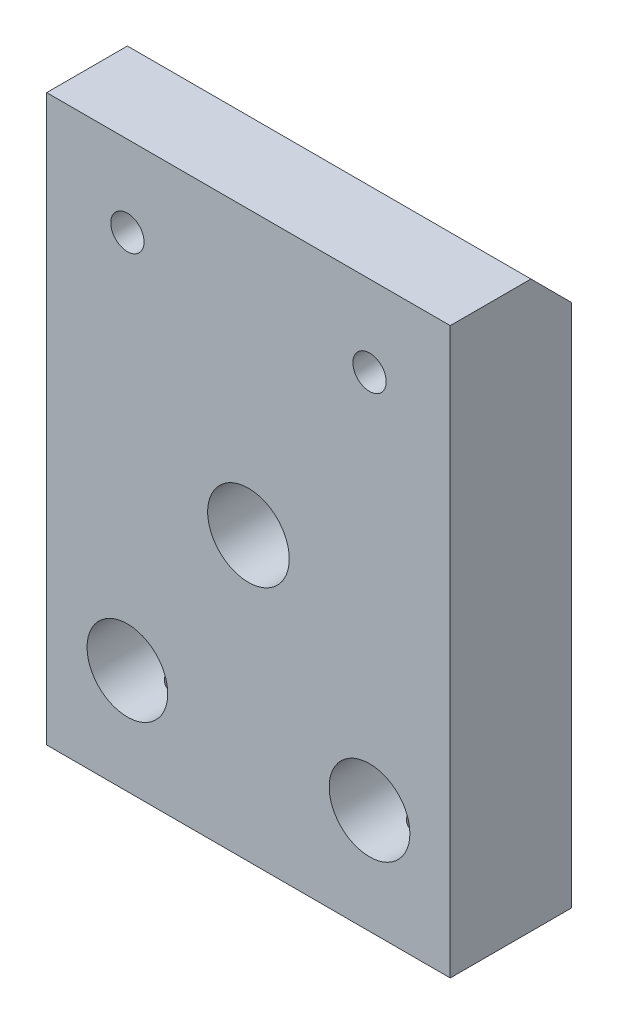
ISO-10303-21;
HEADER;
FILE_DESCRIPTION(('STEP AP214'),'2;1');
FILE_NAME('part.step','',(''),(''),'','','');
FILE_SCHEMA(('AUTOMOTIVE_DESIGN { 1 0 10303 214 1 1 1 1 }'));
ENDSEC;
DATA;
#1=APPLICATION_CONTEXT('core data for automotive mechanical design processes');
#2=APPLICATION_PROTOCOL_DEFINITION('international standard','automotive_design',2000,#1);
#3=PRODUCT_CONTEXT('',#1,'mechanical');
#4=PRODUCT('Part','Part','',(#3));
#5=PRODUCT_RELATED_PRODUCT_CATEGORY('part','',(#4));
#6=PRODUCT_DEFINITION_FORMATION('','',#4);
#7=PRODUCT_DEFINITION_CONTEXT('part definition',#1,'design');
#8=PRODUCT_DEFINITION('design','',#6,#7);
#9=PRODUCT_DEFINITION_SHAPE('','',#8);
#10=(LENGTH_UNIT() NAMED_UNIT(*) SI_UNIT(.MILLI.,.METRE.));
#11=(NAMED_UNIT(*) PLANE_ANGLE_UNIT() SI_UNIT($,.RADIAN.));
#12=(NAMED_UNIT(*) SI_UNIT($,.STERADIAN.) SOLID_ANGLE_UNIT());
#13=UNCERTAINTY_MEASURE_WITH_UNIT(LENGTH_MEASURE(1.E-05),#10,'distance_accuracy_value','');
#14=(GEOMETRIC_REPRESENTATION_CONTEXT(3) GLOBAL_UNCERTAINTY_ASSIGNED_CONTEXT((#13)) GLOBAL_UNIT_ASSIGNED_CONTEXT((#10,
#11,#12)) REPRESENTATION_CONTEXT('',''));
#15=CARTESIAN_POINT('',(0.,0.,0.));
#16=DIRECTION('',(0.,0.,1.));
#17=DIRECTION('',(1.,0.,0.));
#18=AXIS2_PLACEMENT_3D('',#15,#16,#17);
#19=CARTESIAN_POINT('',(-25.,0.,15.));
#20=DIRECTION('',(0.,1.,0.));
#21=DIRECTION('',(0.,0.,1.));
#22=AXIS2_PLACEMENT_3D('',#19,#20,#21);
#23=PLANE('',#22);
#24=DIRECTION('',(1.,0.,0.));
#25=VECTOR('',#24,1.);
#26=CARTESIAN_POINT('',(-25.,0.,0.));
#27=LINE('',#26,#25);
#28=CARTESIAN_POINT('',(-25.,0.,0.));
#29=VERTEX_POINT('',#28);
#30=CARTESIAN_POINT('',(25.,0.,0.));
#31=VERTEX_POINT('',#30);
#32=EDGE_CURVE('E79',#29,#31,#27,.T.);
#33=ORIENTED_EDGE('',*,*,#32,.T.);
#34=DIRECTION('',(0.,0.,-1.));
#35=VECTOR('',#34,1.);
#36=CARTESIAN_POINT('',(25.,0.,15.));
#37=LINE('',#36,#35);
#38=CARTESIAN_POINT('',(25.,0.,15.));
#39=VERTEX_POINT('',#38);
#40=EDGE_CURVE('E85',#39,#31,#37,.T.);
#41=ORIENTED_EDGE('',*,*,#40,.F.);
#42=DIRECTION('',(1.,0.,0.));
#43=VECTOR('',#42,1.);
#44=CARTESIAN_POINT('',(-25.,0.,15.));
#45=LINE('',#44,#43);
#46=CARTESIAN_POINT('',(-25.,0.,15.));
#47=VERTEX_POINT('',#46);
#48=EDGE_CURVE('E81',#47,#39,#45,.T.);
#49=ORIENTED_EDGE('',*,*,#48,.F.);
#50=DIRECTION('',(0.,0.,-1.));
#51=VECTOR('',#50,1.);
#52=CARTESIAN_POINT('',(-25.,0.,15.));
#53=LINE('',#52,#51);
#54=EDGE_CURVE('E75',#47,#29,#53,.T.);
#55=ORIENTED_EDGE('',*,*,#54,.T.);
#56=EDGE_LOOP('',(#33,#41,#49,#55));
#57=FACE_BOUND('',#56,.T.);
#58=CARTESIAN_POINT('',(15.,0.,7.5));
#59=DIRECTION('',(0.,-1.,0.));
#60=DIRECTION('',(0.,0.,-1.));
#61=AXIS2_PLACEMENT_3D('',#58,#59,#60);
#62=CIRCLE('',#61,2.065);
#63=CARTESIAN_POINT('',(15.,0.,5.435));
#64=VERTEX_POINT('',#63);
#65=EDGE_CURVE('E229',#64,#64,#62,.T.);
#66=ORIENTED_EDGE('',*,*,#65,.F.);
#67=EDGE_LOOP('',(#66));
#68=FACE_BOUND('',#67,.T.);
#69=CARTESIAN_POINT('',(-15.,0.,7.5));
#70=DIRECTION('',(0.,1.,0.));
#71=DIRECTION('',(0.,0.,1.));
#72=AXIS2_PLACEMENT_3D('',#69,#70,#71);
#73=CIRCLE('',#72,2.065);
#74=CARTESIAN_POINT('',(-15.,0.,9.565));
#75=VERTEX_POINT('',#74);
#76=EDGE_CURVE('E226',#75,#75,#73,.T.);
#77=ORIENTED_EDGE('',*,*,#76,.T.);
#78=EDGE_LOOP('',(#77));
#79=FACE_BOUND('',#78,.T.);
#80=ADVANCED_FACE('F29',(#57,#68,#79),#23,.F.);
#81=CARTESIAN_POINT('',(-15.,13.,15.));
#82=DIRECTION('',(0.,0.,-1.));
#83=DIRECTION('',(-1.,0.,0.));
#84=AXIS2_PLACEMENT_3D('',#81,#82,#83);
#85=CYLINDRICAL_SURFACE('',#84,5.);
#86=CARTESIAN_POINT('',(-15.,13.,0.));
#87=DIRECTION('',(0.,0.,-1.));
#88=DIRECTION('',(-1.,0.,0.));
#89=AXIS2_PLACEMENT_3D('',#86,#87,#88);
#90=CIRCLE('',#89,5.);
#91=CARTESIAN_POINT('',(-20.,13.,0.));
#92=VERTEX_POINT('',#91);
#93=EDGE_CURVE('E203',#92,#92,#90,.T.);
#94=ORIENTED_EDGE('',*,*,#93,.T.);
#95=EDGE_LOOP('',(#94));
#96=FACE_BOUND('',#95,.T.);
#97=CARTESIAN_POINT('',(-15.,13.,15.));
#98=DIRECTION('',(0.,0.,-1.));
#99=DIRECTION('',(-1.,0.,0.));
#100=AXIS2_PLACEMENT_3D('',#97,#98,#99);
#101=CIRCLE('',#100,5.);
#102=CARTESIAN_POINT('',(-20.,13.,15.));
#103=VERTEX_POINT('',#102);
#104=EDGE_CURVE('E206',#103,#103,#101,.T.);
#105=ORIENTED_EDGE('',*,*,#104,.F.);
#106=EDGE_LOOP('',(#105));
#107=FACE_BOUND('',#106,.T.);
#108=CARTESIAN_POINT('',(-15.,8.,5.435));
#109=CARTESIAN_POINT('',(-14.8893026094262,8.00000867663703,5.43501158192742));
#110=CARTESIAN_POINT('',(-14.7784269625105,8.00371890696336,5.44395402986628));
#111=CARTESIAN_POINT('',(-14.5598143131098,8.01820133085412,5.47940818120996));
#112=CARTESIAN_POINT('',(-14.4520863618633,8.02899212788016,5.50596616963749));
#113=CARTESIAN_POINT('',(-14.243288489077,8.05647543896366,5.5755068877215));
#114=CARTESIAN_POINT('',(-14.1421975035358,8.07314809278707,5.61843438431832));
#115=CARTESIAN_POINT('',(-13.9487483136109,8.11076754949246,5.7192695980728));
#116=CARTESIAN_POINT('',(-13.8563873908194,8.13171301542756,5.77717263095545));
#117=CARTESIAN_POINT('',(-13.6783021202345,8.17693718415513,5.90934458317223));
#118=CARTESIAN_POINT('',(-13.5930668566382,8.2013237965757,5.98423524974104));
#119=CARTESIAN_POINT('',(-13.4359468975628,8.25020822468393,6.14694256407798));
#120=CARTESIAN_POINT('',(-13.3640691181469,8.27470609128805,6.23476586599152));
#121=CARTESIAN_POINT('',(-13.2322878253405,8.32235683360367,6.42597291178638));
#122=CARTESIAN_POINT('',(-13.1731273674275,8.3453881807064,6.52990222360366));
#123=CARTESIAN_POINT('',(-13.0733461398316,8.38579102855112,6.747327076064));
#124=CARTESIAN_POINT('',(-13.0327159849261,8.40316539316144,6.86081773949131));
#125=CARTESIAN_POINT('',(-12.9731591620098,8.42912126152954,7.08851584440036));
#126=CARTESIAN_POINT('',(-12.9532922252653,8.4380816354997,7.20243251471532));
#127=CARTESIAN_POINT('',(-12.932891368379,8.44728647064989,7.4323078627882));
#128=CARTESIAN_POINT('',(-12.9323470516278,8.447535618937,7.54826540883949));
#129=CARTESIAN_POINT('',(-12.9498977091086,8.43961107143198,7.76964088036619));
#130=CARTESIAN_POINT('',(-12.9665965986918,8.43206822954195,7.87519657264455));
#131=CARTESIAN_POINT('',(-13.0158210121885,8.41047405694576,8.08184665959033));
#132=CARTESIAN_POINT('',(-13.0483495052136,8.39642150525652,8.18294021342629));
#133=CARTESIAN_POINT('',(-13.1289410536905,8.36307564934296,8.38032487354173));
#134=CARTESIAN_POINT('',(-13.1773173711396,8.34367803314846,8.47646966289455));
#135=CARTESIAN_POINT('',(-13.2880102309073,8.30185292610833,8.65964621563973));
#136=CARTESIAN_POINT('',(-13.350332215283,8.27942425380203,8.74667440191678));
#137=CARTESIAN_POINT('',(-13.4932136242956,8.23180178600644,8.91673969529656));
#138=CARTESIAN_POINT('',(-13.5748565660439,8.20653289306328,8.99884799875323));
#139=CARTESIAN_POINT('',(-13.7510081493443,8.15764848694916,9.1485160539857));
#140=CARTESIAN_POINT('',(-13.8455196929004,8.13403334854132,9.21607251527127));
#141=CARTESIAN_POINT('',(-14.0475060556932,8.09045316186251,9.33604879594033));
#142=CARTESIAN_POINT('',(-14.1552230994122,8.07058133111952,9.38809717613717));
#143=CARTESIAN_POINT('',(-14.3789141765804,8.03743977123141,9.47300972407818));
#144=CARTESIAN_POINT('',(-14.4948836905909,8.02416645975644,9.50588430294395));
#145=CARTESIAN_POINT('',(-14.7240205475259,8.00638303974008,9.54958673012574));
#146=CARTESIAN_POINT('',(-14.8369117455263,8.00137812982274,9.56166143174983));
#147=CARTESIAN_POINT('',(-15.0632086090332,7.99912067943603,9.56713065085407));
#148=CARTESIAN_POINT('',(-15.1766141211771,8.00186596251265,9.56053041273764));
#149=CARTESIAN_POINT('',(-15.3949236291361,8.01447878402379,9.52973530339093));
#150=CARTESIAN_POINT('',(-15.4999730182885,8.02399392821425,9.50641054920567));
#151=CARTESIAN_POINT('',(-15.704556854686,8.0488157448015,9.44403344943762));
#152=CARTESIAN_POINT('',(-15.8040906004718,8.0641231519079,9.40497910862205));
#153=CARTESIAN_POINT('',(-15.9982960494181,8.09964729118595,9.31097479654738));
#154=CARTESIAN_POINT('',(-16.0927215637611,8.12000143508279,9.2555698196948));
#155=CARTESIAN_POINT('',(-16.2712719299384,8.16343874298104,9.13093793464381));
#156=CARTESIAN_POINT('',(-16.3553924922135,8.18652303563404,9.06170530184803));
#157=CARTESIAN_POINT('',(-16.5171549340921,8.23493299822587,8.90568902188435));
#158=CARTESIAN_POINT('',(-16.5939263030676,8.26030218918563,8.81801397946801));
#159=CARTESIAN_POINT('',(-16.7319028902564,8.30895763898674,8.63061016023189));
#160=CARTESIAN_POINT('',(-16.7931048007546,8.3322434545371,8.5308788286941));
#161=CARTESIAN_POINT('',(-16.8988015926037,8.37421964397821,8.32026387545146));
#162=CARTESIAN_POINT('',(-16.9430656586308,8.39284540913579,8.20925059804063));
#163=CARTESIAN_POINT('',(-17.0119034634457,8.42248153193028,7.98033726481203));
#164=CARTESIAN_POINT('',(-17.0364930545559,8.43349801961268,7.86244283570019));
#165=CARTESIAN_POINT('',(-17.0637217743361,8.44574322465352,7.63275468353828));
#166=CARTESIAN_POINT('',(-17.0678851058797,8.44765128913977,7.52117696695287));
#167=CARTESIAN_POINT('',(-17.0581974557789,8.44326298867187,7.29898228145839));
#168=CARTESIAN_POINT('',(-17.0443491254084,8.43696783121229,7.18836517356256));
#169=CARTESIAN_POINT('',(-17.0003039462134,8.41749858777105,6.97634738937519));
#170=CARTESIAN_POINT('',(-16.9708697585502,8.40464635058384,6.87475592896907));
#171=CARTESIAN_POINT('',(-16.897226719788,8.37375782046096,6.6779259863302));
#172=CARTESIAN_POINT('',(-16.8530137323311,8.35572007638,6.58268929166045));
#173=CARTESIAN_POINT('',(-16.7480350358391,8.31516114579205,6.39508753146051));
#174=CARTESIAN_POINT('',(-16.6864406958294,8.29243699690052,6.30323082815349));
#175=CARTESIAN_POINT('',(-16.5496193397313,8.24564377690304,6.13067964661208));
#176=CARTESIAN_POINT('',(-16.4743877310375,8.22157425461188,6.04998894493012));
#177=CARTESIAN_POINT('',(-16.3060799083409,8.17274855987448,5.8961675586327));
#178=CARTESIAN_POINT('',(-16.2121158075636,8.14806503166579,5.82398082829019));
#179=CARTESIAN_POINT('',(-16.0124873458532,8.10251750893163,5.6963581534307));
#180=CARTESIAN_POINT('',(-15.9068176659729,8.08165526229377,5.64092986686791));
#181=CARTESIAN_POINT('',(-15.6884908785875,8.04641513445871,5.5496220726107));
#182=CARTESIAN_POINT('',(-15.5759836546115,8.03193274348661,5.51342532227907));
#183=CARTESIAN_POINT('',(-15.3459613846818,8.01065705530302,5.46079304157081));
#184=CARTESIAN_POINT('',(-15.2284632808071,8.00383961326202,5.44429544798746));
#185=CARTESIAN_POINT('',(-15.0737281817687,8.00040494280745,5.43598325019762));
#186=CARTESIAN_POINT('',(-15.0368739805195,7.99999710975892,5.43499614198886));
#187=CARTESIAN_POINT('',(-15.,8.,5.435));
#188=B_SPLINE_CURVE_WITH_KNOTS('',3,(#108,#109,#110,#111,#112,#113,#114,#115,#116,#117,#118,
#119,#120,#121,#122,#123,#124,#125,#126,#127,#128,#129,#130,#131,#132,#133,#134,#135,#136,#137,
#138,#139,#140,#141,#142,#143,#144,#145,#146,#147,#148,#149,#150,#151,#152,#153,#154,#155,#156,
#157,#158,#159,#160,#161,#162,#163,#164,#165,#166,#167,#168,#169,#170,#171,#172,#173,#174,#175,
#176,#177,#178,#179,#180,#181,#182,#183,#184,#185,#186,#187),.UNSPECIFIED.,.T.,.F.,(4,2,2,2,2,2,
2,2,2,2,2,2,2,2,2,2,2,2,2,2,2,2,2,2,2,2,2,2,2,2,2,2,2,2,2,2,2,2,2,4),(0.,0.331988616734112,
0.664853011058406,0.996604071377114,1.32825148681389,1.67489852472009,2.02172454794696,
2.38524751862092,2.74858616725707,3.09464535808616,3.44051834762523,3.76042850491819,
4.08039868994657,4.40711944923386,4.73396792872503,5.08790948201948,5.44193098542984,
5.8038529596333,6.1655782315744,6.50474912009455,6.84382477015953,7.1664319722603,
7.48908010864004,7.82172488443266,8.15450766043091,8.51067284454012,8.86691363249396,
9.2278493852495,9.58849402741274,9.9217693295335,10.254995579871,10.5732468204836,
10.8915872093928,11.2288764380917,11.5662794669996,11.9276457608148,12.289176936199,
12.6445429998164,12.9987864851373,13.1093739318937),.UNSPECIFIED.);
#189=CARTESIAN_POINT('',(-15.,8.,5.435));
#190=VERTEX_POINT('',#189);
#191=EDGE_CURVE('E223',#190,#190,#188,.T.);
#192=ORIENTED_EDGE('',*,*,#191,.T.);
#193=EDGE_LOOP('',(#192));
#194=FACE_BOUND('',#193,.T.);
#195=ADVANCED_FACE('F143',(#96,#107,#194),#85,.F.);
#196=CARTESIAN_POINT('',(25.,70.,15.));
#197=DIRECTION('',(0.,0.,1.));
#198=DIRECTION('',(1.,0.,0.));
#199=AXIS2_PLACEMENT_3D('',#196,#197,#198);
#200=PLANE('',#199);
#201=CARTESIAN_POINT('',(15.,60.,15.));
#202=DIRECTION('',(0.,0.,-1.));
#203=DIRECTION('',(-1.,0.,0.));
#204=AXIS2_PLACEMENT_3D('',#201,#202,#203);
#205=CIRCLE('',#204,2.065);
#206=CARTESIAN_POINT('',(12.935,60.,15.));
#207=VERTEX_POINT('',#206);
#208=EDGE_CURVE('E189',#207,#207,#205,.T.);
#209=ORIENTED_EDGE('',*,*,#208,.T.);
#210=EDGE_LOOP('',(#209));
#211=FACE_BOUND('',#210,.T.);
#212=CARTESIAN_POINT('',(0.,35.,15.));
#213=DIRECTION('',(0.,0.,1.));
#214=DIRECTION('',(1.,0.,0.));
#215=AXIS2_PLACEMENT_3D('',#212,#213,#214);
#216=CIRCLE('',#215,5.055);
#217=CARTESIAN_POINT('',(5.055,35.,15.));
#218=VERTEX_POINT('',#217);
#219=EDGE_CURVE('E200',#218,#218,#216,.T.);
#220=ORIENTED_EDGE('',*,*,#219,.F.);
#221=EDGE_LOOP('',(#220));
#222=FACE_BOUND('',#221,.T.);
#223=ORIENTED_EDGE('',*,*,#104,.T.);
#224=EDGE_LOOP('',(#223));
#225=FACE_BOUND('',#224,.T.);
#226=DIRECTION('',(0.,1.,0.));
#227=VECTOR('',#226,1.);
#228=CARTESIAN_POINT('',(25.,0.,15.));
#229=LINE('',#228,#227);
#230=CARTESIAN_POINT('',(25.,70.,15.));
#231=VERTEX_POINT('',#230);
#232=EDGE_CURVE('E91',#39,#231,#229,.T.);
#233=ORIENTED_EDGE('',*,*,#232,.T.);
#234=DIRECTION('',(-1.,0.,0.));
#235=VECTOR('',#234,1.);
#236=CARTESIAN_POINT('',(25.,70.,15.));
#237=LINE('',#236,#235);
#238=CARTESIAN_POINT('',(-25.,70.,15.));
#239=VERTEX_POINT('',#238);
#240=EDGE_CURVE('E101',#231,#239,#237,.T.);
#241=ORIENTED_EDGE('',*,*,#240,.T.);
#242=DIRECTION('',(0.,1.,0.));
#243=VECTOR('',#242,1.);
#244=CARTESIAN_POINT('',(-25.,0.,15.));
#245=LINE('',#244,#243);
#246=EDGE_CURVE('E103',#47,#239,#245,.T.);
#247=ORIENTED_EDGE('',*,*,#246,.F.);
#248=ORIENTED_EDGE('',*,*,#48,.T.);
#249=EDGE_LOOP('',(#233,#241,#247,#248));
#250=FACE_BOUND('',#249,.T.);
#251=CARTESIAN_POINT('',(15.,13.,15.));
#252=DIRECTION('',(0.,0.,1.));
#253=DIRECTION('',(1.,0.,0.));
#254=AXIS2_PLACEMENT_3D('',#251,#252,#253);
#255=CIRCLE('',#254,5.);
#256=CARTESIAN_POINT('',(20.,13.,15.));
#257=VERTEX_POINT('',#256);
#258=EDGE_CURVE('E95',#257,#257,#255,.T.);
#259=ORIENTED_EDGE('',*,*,#258,.F.);
#260=EDGE_LOOP('',(#259));
#261=FACE_BOUND('',#260,.T.);
#262=CARTESIAN_POINT('',(-15.,60.,15.));
#263=DIRECTION('',(0.,0.,1.));
#264=DIRECTION('',(1.,0.,0.));
#265=AXIS2_PLACEMENT_3D('',#262,#263,#264);
#266=CIRCLE('',#265,2.065);
#267=CARTESIAN_POINT('',(-12.935,60.,15.));
#268=VERTEX_POINT('',#267);
#269=EDGE_CURVE('E184',#268,#268,#266,.T.);
#270=ORIENTED_EDGE('',*,*,#269,.F.);
#271=EDGE_LOOP('',(#270));
#272=FACE_BOUND('',#271,.T.);
#273=ADVANCED_FACE('F122',(#211,#222,#225,#250,#261,#272),#200,.T.);
#274=CARTESIAN_POINT('',(25.,70.,0.));
#275=DIRECTION('',(0.,0.,1.));
#276=DIRECTION('',(1.,0.,0.));
#277=AXIS2_PLACEMENT_3D('',#274,#275,#276);
#278=PLANE('',#277);
#279=CARTESIAN_POINT('',(15.,60.,0.));
#280=DIRECTION('',(0.,0.,-1.));
#281=DIRECTION('',(-1.,0.,0.));
#282=AXIS2_PLACEMENT_3D('',#279,#280,#281);
#283=CIRCLE('',#282,2.065);
#284=CARTESIAN_POINT('',(12.935,60.,0.));
#285=VERTEX_POINT('',#284);
#286=EDGE_CURVE('E194',#285,#285,#283,.T.);
#287=ORIENTED_EDGE('',*,*,#286,.F.);
#288=EDGE_LOOP('',(#287));
#289=FACE_BOUND('',#288,.T.);
#290=CARTESIAN_POINT('',(0.,35.,0.));
#291=DIRECTION('',(0.,0.,1.));
#292=DIRECTION('',(1.,0.,0.));
#293=AXIS2_PLACEMENT_3D('',#290,#291,#292);
#294=CIRCLE('',#293,5.055);
#295=CARTESIAN_POINT('',(5.055,35.,0.));
#296=VERTEX_POINT('',#295);
#297=EDGE_CURVE('E191',#296,#296,#294,.T.);
#298=ORIENTED_EDGE('',*,*,#297,.T.);
#299=EDGE_LOOP('',(#298));
#300=FACE_BOUND('',#299,.T.);
#301=ORIENTED_EDGE('',*,*,#93,.F.);
#302=EDGE_LOOP('',(#301));
#303=FACE_BOUND('',#302,.T.);
#304=DIRECTION('',(0.,1.,0.));
#305=VECTOR('',#304,1.);
#306=CARTESIAN_POINT('',(-25.,0.,0.));
#307=LINE('',#306,#305);
#308=CARTESIAN_POINT('',(-25.,65.,0.));
#309=VERTEX_POINT('',#308);
#310=EDGE_CURVE('E89',#29,#309,#307,.T.);
#311=ORIENTED_EDGE('',*,*,#310,.T.);
#312=DIRECTION('',(1.,0.,0.));
#313=VECTOR('',#312,1.);
#314=CARTESIAN_POINT('',(25.,65.,0.));
#315=LINE('',#314,#313);
#316=CARTESIAN_POINT('',(25.,65.,0.));
#317=VERTEX_POINT('',#316);
#318=EDGE_CURVE('E37',#309,#317,#315,.T.);
#319=ORIENTED_EDGE('',*,*,#318,.T.);
#320=DIRECTION('',(0.,1.,0.));
#321=VECTOR('',#320,1.);
#322=CARTESIAN_POINT('',(25.,0.,0.));
#323=LINE('',#322,#321);
#324=EDGE_CURVE('E90',#31,#317,#323,.T.);
#325=ORIENTED_EDGE('',*,*,#324,.F.);
#326=ORIENTED_EDGE('',*,*,#32,.F.);
#327=EDGE_LOOP('',(#311,#319,#325,#326));
#328=FACE_BOUND('',#327,.T.);
#329=CARTESIAN_POINT('',(15.,13.,0.));
#330=DIRECTION('',(0.,0.,1.));
#331=DIRECTION('',(1.,0.,0.));
#332=AXIS2_PLACEMENT_3D('',#329,#330,#331);
#333=CIRCLE('',#332,5.);
#334=CARTESIAN_POINT('',(20.,13.,0.));
#335=VERTEX_POINT('',#334);
#336=EDGE_CURVE('E209',#335,#335,#333,.T.);
#337=ORIENTED_EDGE('',*,*,#336,.T.);
#338=EDGE_LOOP('',(#337));
#339=FACE_BOUND('',#338,.T.);
#340=CARTESIAN_POINT('',(-15.,60.,0.));
#341=DIRECTION('',(0.,0.,1.));
#342=DIRECTION('',(1.,0.,0.));
#343=AXIS2_PLACEMENT_3D('',#340,#341,#342);
#344=CIRCLE('',#343,2.065);
#345=CARTESIAN_POINT('',(-12.935,60.,0.));
#346=VERTEX_POINT('',#345);
#347=EDGE_CURVE('E187',#346,#346,#344,.T.);
#348=ORIENTED_EDGE('',*,*,#347,.T.);
#349=EDGE_LOOP('',(#348));
#350=FACE_BOUND('',#349,.T.);
#351=ADVANCED_FACE('F87',(#289,#300,#303,#328,#339,#350),#278,.F.);
#352=CARTESIAN_POINT('',(25.,0.,15.));
#353=DIRECTION('',(-1.,0.,0.));
#354=DIRECTION('',(0.,0.,1.));
#355=AXIS2_PLACEMENT_3D('',#352,#353,#354);
#356=PLANE('',#355);
#357=ORIENTED_EDGE('',*,*,#324,.T.);
#358=DIRECTION('',(0.,-0.707106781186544,-0.707106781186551));
#359=VECTOR('',#358,1.);
#360=CARTESIAN_POINT('',(25.,70.,5.00000000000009));
#361=LINE('',#360,#359);
#362=CARTESIAN_POINT('',(25.,70.,5.00000000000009));
#363=VERTEX_POINT('',#362);
#364=EDGE_CURVE('E11',#317,#363,#361,.F.);
#365=ORIENTED_EDGE('',*,*,#364,.T.);
#366=DIRECTION('',(0.,0.,-1.));
#367=VECTOR('',#366,1.);
#368=CARTESIAN_POINT('',(25.,70.,15.));
#369=LINE('',#368,#367);
#370=EDGE_CURVE('E108',#231,#363,#369,.T.);
#371=ORIENTED_EDGE('',*,*,#370,.F.);
#372=ORIENTED_EDGE('',*,*,#232,.F.);
#373=ORIENTED_EDGE('',*,*,#40,.T.);
#374=EDGE_LOOP('',(#357,#365,#371,#372,#373));
#375=FACE_BOUND('',#374,.T.);
#376=ADVANCED_FACE('F31',(#375),#356,.F.);
#377=CARTESIAN_POINT('',(25.,70.,15.));
#378=DIRECTION('',(0.,-1.,0.));
#379=DIRECTION('',(0.,0.,-1.));
#380=AXIS2_PLACEMENT_3D('',#377,#378,#379);
#381=PLANE('',#380);
#382=ORIENTED_EDGE('',*,*,#370,.T.);
#383=DIRECTION('',(-1.,0.,0.));
#384=VECTOR('',#383,1.);
#385=CARTESIAN_POINT('',(25.,70.,5.00000000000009));
#386=LINE('',#385,#384);
#387=CARTESIAN_POINT('',(-25.,70.,5.00000000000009));
#388=VERTEX_POINT('',#387);
#389=EDGE_CURVE('E111',#363,#388,#386,.T.);
#390=ORIENTED_EDGE('',*,*,#389,.T.);
#391=DIRECTION('',(0.,0.,-1.));
#392=VECTOR('',#391,1.);
#393=CARTESIAN_POINT('',(-25.,70.,15.));
#394=LINE('',#393,#392);
#395=EDGE_CURVE('E84',#239,#388,#394,.T.);
#396=ORIENTED_EDGE('',*,*,#395,.F.);
#397=ORIENTED_EDGE('',*,*,#240,.F.);
#398=EDGE_LOOP('',(#382,#390,#396,#397));
#399=FACE_BOUND('',#398,.T.);
#400=ADVANCED_FACE('F117',(#399),#381,.F.);
#401=CARTESIAN_POINT('',(-25.,0.,15.));
#402=DIRECTION('',(-1.,0.,0.));
#403=DIRECTION('',(0.,0.,1.));
#404=AXIS2_PLACEMENT_3D('',#401,#402,#403);
#405=PLANE('',#404);
#406=ORIENTED_EDGE('',*,*,#395,.T.);
#407=DIRECTION('',(0.,0.707106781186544,0.707106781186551));
#408=VECTOR('',#407,1.);
#409=CARTESIAN_POINT('',(-25.,40.0000000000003,-24.9999999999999));
#410=LINE('',#409,#408);
#411=EDGE_CURVE('E51',#388,#309,#410,.F.);
#412=ORIENTED_EDGE('',*,*,#411,.T.);
#413=ORIENTED_EDGE('',*,*,#310,.F.);
#414=ORIENTED_EDGE('',*,*,#54,.F.);
#415=ORIENTED_EDGE('',*,*,#246,.T.);
#416=EDGE_LOOP('',(#406,#412,#413,#414,#415));
#417=FACE_BOUND('',#416,.T.);
#418=ADVANCED_FACE('F93',(#417),#405,.T.);
#419=CARTESIAN_POINT('',(15.,13.,15.));
#420=DIRECTION('',(0.,0.,-1.));
#421=DIRECTION('',(-1.,0.,0.));
#422=AXIS2_PLACEMENT_3D('',#419,#420,#421);
#423=CYLINDRICAL_SURFACE('',#422,5.);
#424=CARTESIAN_POINT('',(15.,8.,5.435));
#425=CARTESIAN_POINT('',(15.1106973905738,8.00000867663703,5.43501158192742));
#426=CARTESIAN_POINT('',(15.2215730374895,8.00371890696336,5.44395402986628));
#427=CARTESIAN_POINT('',(15.4401856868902,8.01820133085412,5.47940818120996));
#428=CARTESIAN_POINT('',(15.5479136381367,8.02899212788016,5.50596616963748));
#429=CARTESIAN_POINT('',(15.756711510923,8.05647543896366,5.5755068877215));
#430=CARTESIAN_POINT('',(15.8578024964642,8.07314809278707,5.61843438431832));
#431=CARTESIAN_POINT('',(16.0512516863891,8.11076754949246,5.7192695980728));
#432=CARTESIAN_POINT('',(16.1436126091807,8.13171301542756,5.77717263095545));
#433=CARTESIAN_POINT('',(16.3216978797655,8.17693718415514,5.90934458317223));
#434=CARTESIAN_POINT('',(16.4069331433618,8.2013237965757,5.98423524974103));
#435=CARTESIAN_POINT('',(16.5640531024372,8.25020822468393,6.14694256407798));
#436=CARTESIAN_POINT('',(16.6359308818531,8.27470609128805,6.23476586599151));
#437=CARTESIAN_POINT('',(16.7677121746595,8.32235683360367,6.42597291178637));
#438=CARTESIAN_POINT('',(16.8268726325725,8.3453881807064,6.52990222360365));
#439=CARTESIAN_POINT('',(16.9266538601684,8.38579102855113,6.74732707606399));
#440=CARTESIAN_POINT('',(16.9672840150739,8.40316539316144,6.86081773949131));
#441=CARTESIAN_POINT('',(17.0268408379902,8.42912126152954,7.08851584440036));
#442=CARTESIAN_POINT('',(17.0467077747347,8.4380816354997,7.20243251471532));
#443=CARTESIAN_POINT('',(17.067108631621,8.44728647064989,7.4323078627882));
#444=CARTESIAN_POINT('',(17.0676529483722,8.447535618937,7.54826540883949));
#445=CARTESIAN_POINT('',(17.0501022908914,8.43961107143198,7.76964088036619));
#446=CARTESIAN_POINT('',(17.0334034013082,8.43206822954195,7.87519657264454));
#447=CARTESIAN_POINT('',(16.9841789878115,8.41047405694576,8.08184665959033));
#448=CARTESIAN_POINT('',(16.9516504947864,8.39642150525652,8.18294021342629));
#449=CARTESIAN_POINT('',(16.8710589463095,8.36307564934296,8.38032487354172));
#450=CARTESIAN_POINT('',(16.8226826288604,8.34367803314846,8.47646966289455));
#451=CARTESIAN_POINT('',(16.7119897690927,8.30185292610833,8.65964621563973));
#452=CARTESIAN_POINT('',(16.649667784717,8.27942425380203,8.74667440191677));
#453=CARTESIAN_POINT('',(16.5067863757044,8.23180178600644,8.91673969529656));
#454=CARTESIAN_POINT('',(16.4251434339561,8.20653289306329,8.99884799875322));
#455=CARTESIAN_POINT('',(16.2489918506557,8.15764848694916,9.1485160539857));
#456=CARTESIAN_POINT('',(16.1544803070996,8.13403334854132,9.21607251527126));
#457=CARTESIAN_POINT('',(15.9524939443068,8.09045316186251,9.33604879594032));
#458=CARTESIAN_POINT('',(15.8447769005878,8.07058133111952,9.38809717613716));
#459=CARTESIAN_POINT('',(15.6210858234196,8.03743977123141,9.47300972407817));
#460=CARTESIAN_POINT('',(15.5051163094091,8.02416645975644,9.50588430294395));
#461=CARTESIAN_POINT('',(15.2759794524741,8.00638303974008,9.54958673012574));
#462=CARTESIAN_POINT('',(15.1630882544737,8.00137812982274,9.56166143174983));
#463=CARTESIAN_POINT('',(14.9367913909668,7.99912067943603,9.56713065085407));
#464=CARTESIAN_POINT('',(14.8233858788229,8.00186596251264,9.56053041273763));
#465=CARTESIAN_POINT('',(14.605076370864,8.01447878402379,9.52973530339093));
#466=CARTESIAN_POINT('',(14.5000269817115,8.02399392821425,9.50641054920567));
#467=CARTESIAN_POINT('',(14.295443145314,8.0488157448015,9.44403344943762));
#468=CARTESIAN_POINT('',(14.1959093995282,8.0641231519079,9.40497910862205));
#469=CARTESIAN_POINT('',(14.0017039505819,8.09964729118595,9.31097479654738));
#470=CARTESIAN_POINT('',(13.9072784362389,8.12000143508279,9.2555698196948));
#471=CARTESIAN_POINT('',(13.7287280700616,8.16343874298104,9.13093793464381));
#472=CARTESIAN_POINT('',(13.6446075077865,8.18652303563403,9.06170530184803));
#473=CARTESIAN_POINT('',(13.4828450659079,8.23493299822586,8.90568902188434));
#474=CARTESIAN_POINT('',(13.4060736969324,8.26030218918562,8.81801397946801));
#475=CARTESIAN_POINT('',(13.2680971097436,8.30895763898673,8.63061016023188));
#476=CARTESIAN_POINT('',(13.2068951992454,8.3322434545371,8.5308788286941));
#477=CARTESIAN_POINT('',(13.1011984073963,8.3742196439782,8.32026387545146));
#478=CARTESIAN_POINT('',(13.0569343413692,8.39284540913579,8.20925059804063));
#479=CARTESIAN_POINT('',(12.9880965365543,8.42248153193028,7.98033726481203));
#480=CARTESIAN_POINT('',(12.9635069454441,8.43349801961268,7.86244283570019));
#481=CARTESIAN_POINT('',(12.9362782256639,8.44574322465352,7.63275468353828));
#482=CARTESIAN_POINT('',(12.9321148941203,8.44765128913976,7.52117696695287));
#483=CARTESIAN_POINT('',(12.9418025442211,8.44326298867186,7.29898228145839));
#484=CARTESIAN_POINT('',(12.9556508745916,8.43696783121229,7.18836517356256));
#485=CARTESIAN_POINT('',(12.9996960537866,8.41749858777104,6.97634738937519));
#486=CARTESIAN_POINT('',(13.0291302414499,8.40464635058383,6.87475592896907));
#487=CARTESIAN_POINT('',(13.102773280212,8.37375782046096,6.6779259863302));
#488=CARTESIAN_POINT('',(13.1469862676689,8.35572007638,6.58268929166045));
#489=CARTESIAN_POINT('',(13.2519649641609,8.31516114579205,6.39508753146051));
#490=CARTESIAN_POINT('',(13.3135593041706,8.29243699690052,6.30323082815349));
#491=CARTESIAN_POINT('',(13.4503806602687,8.24564377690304,6.13067964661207));
#492=CARTESIAN_POINT('',(13.5256122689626,8.22157425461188,6.04998894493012));
#493=CARTESIAN_POINT('',(13.6939200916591,8.17274855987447,5.89616755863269));
#494=CARTESIAN_POINT('',(13.7878841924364,8.14806503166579,5.82398082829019));
#495=CARTESIAN_POINT('',(13.9875126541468,8.10251750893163,5.6963581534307));
#496=CARTESIAN_POINT('',(14.0931823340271,8.08165526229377,5.64092986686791));
#497=CARTESIAN_POINT('',(14.3115091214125,8.04641513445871,5.54962207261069));
#498=CARTESIAN_POINT('',(14.4240163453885,8.03193274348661,5.51342532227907));
#499=CARTESIAN_POINT('',(14.6540386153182,8.01065705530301,5.46079304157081));
#500=CARTESIAN_POINT('',(14.7715367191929,8.00383961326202,5.44429544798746));
#501=CARTESIAN_POINT('',(14.9262718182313,8.00040494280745,5.43598325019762));
#502=CARTESIAN_POINT('',(14.9631260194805,7.99999710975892,5.43499614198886));
#503=CARTESIAN_POINT('',(15.,8.,5.435));
#504=B_SPLINE_CURVE_WITH_KNOTS('',3,(#424,#425,#426,#427,#428,#429,#430,#431,#432,#433,#434,
#435,#436,#437,#438,#439,#440,#441,#442,#443,#444,#445,#446,#447,#448,#449,#450,#451,#452,#453,
#454,#455,#456,#457,#458,#459,#460,#461,#462,#463,#464,#465,#466,#467,#468,#469,#470,#471,#472,
#473,#474,#475,#476,#477,#478,#479,#480,#481,#482,#483,#484,#485,#486,#487,#488,#489,#490,#491,
#492,#493,#494,#495,#496,#497,#498,#499,#500,#501,#502,#503),.UNSPECIFIED.,.T.,.F.,(4,2,2,2,2,2,
2,2,2,2,2,2,2,2,2,2,2,2,2,2,2,2,2,2,2,2,2,2,2,2,2,2,2,2,2,2,2,2,2,4),(0.,0.331988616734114,
0.664853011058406,0.99660407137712,1.32825148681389,1.67489852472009,2.02172454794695,
2.38524751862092,2.74858616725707,3.09464535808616,3.44051834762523,3.76042850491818,
4.08039868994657,4.40711944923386,4.73396792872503,5.08790948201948,5.44193098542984,
5.8038529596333,6.1655782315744,6.50474912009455,6.84382477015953,7.16643197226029,
7.48908010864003,7.82172488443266,8.15450766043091,8.51067284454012,8.86691363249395,
9.2278493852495,9.58849402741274,9.92176932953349,10.254995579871,10.5732468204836,
10.8915872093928,11.2288764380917,11.5662794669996,11.9276457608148,12.2891769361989,
12.6445429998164,12.9987864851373,13.1093739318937),.UNSPECIFIED.);
#505=CARTESIAN_POINT('',(15.,8.,5.435));
#506=VERTEX_POINT('',#505);
#507=EDGE_CURVE('E225',#506,#506,#504,.T.);
#508=ORIENTED_EDGE('',*,*,#507,.T.);
#509=EDGE_LOOP('',(#508));
#510=FACE_BOUND('',#509,.T.);
#511=ORIENTED_EDGE('',*,*,#258,.T.);
#512=EDGE_LOOP('',(#511));
#513=FACE_BOUND('',#512,.T.);
#514=ORIENTED_EDGE('',*,*,#336,.F.);
#515=EDGE_LOOP('',(#514));
#516=FACE_BOUND('',#515,.T.);
#517=ADVANCED_FACE('F154',(#510,#513,#516),#423,.F.);
#518=CARTESIAN_POINT('',(0.,35.,15.));
#519=DIRECTION('',(0.,0.,-1.));
#520=DIRECTION('',(-1.,0.,0.));
#521=AXIS2_PLACEMENT_3D('',#518,#519,#520);
#522=CYLINDRICAL_SURFACE('',#521,5.055);
#523=ORIENTED_EDGE('',*,*,#219,.T.);
#524=EDGE_LOOP('',(#523));
#525=FACE_BOUND('',#524,.T.);
#526=ORIENTED_EDGE('',*,*,#297,.F.);
#527=EDGE_LOOP('',(#526));
#528=FACE_BOUND('',#527,.T.);
#529=ADVANCED_FACE('F171',(#525,#528),#522,.F.);
#530=CARTESIAN_POINT('',(-15.,60.,15.));
#531=DIRECTION('',(0.,0.,-1.));
#532=DIRECTION('',(-1.,0.,0.));
#533=AXIS2_PLACEMENT_3D('',#530,#531,#532);
#534=CYLINDRICAL_SURFACE('',#533,2.065);
#535=ORIENTED_EDGE('',*,*,#269,.T.);
#536=EDGE_LOOP('',(#535));
#537=FACE_BOUND('',#536,.T.);
#538=ORIENTED_EDGE('',*,*,#347,.F.);
#539=EDGE_LOOP('',(#538));
#540=FACE_BOUND('',#539,.T.);
#541=ADVANCED_FACE('F138',(#537,#540),#534,.F.);
#542=CARTESIAN_POINT('',(15.,60.,15.));
#543=DIRECTION('',(0.,0.,-1.));
#544=DIRECTION('',(-1.,0.,0.));
#545=AXIS2_PLACEMENT_3D('',#542,#543,#544);
#546=CYLINDRICAL_SURFACE('',#545,2.065);
#547=ORIENTED_EDGE('',*,*,#208,.F.);
#548=EDGE_LOOP('',(#547));
#549=FACE_BOUND('',#548,.T.);
#550=ORIENTED_EDGE('',*,*,#286,.T.);
#551=EDGE_LOOP('',(#550));
#552=FACE_BOUND('',#551,.T.);
#553=ADVANCED_FACE('F129',(#549,#552),#546,.F.);
#554=CARTESIAN_POINT('',(25.,70.,5.00000000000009));
#555=DIRECTION('',(0.,-0.707106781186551,0.707106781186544));
#556=DIRECTION('',(0.,-0.707106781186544,-0.707106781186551));
#557=AXIS2_PLACEMENT_3D('',#554,#555,#556);
#558=PLANE('',#557);
#559=ORIENTED_EDGE('',*,*,#364,.F.);
#560=ORIENTED_EDGE('',*,*,#318,.F.);
#561=ORIENTED_EDGE('',*,*,#411,.F.);
#562=ORIENTED_EDGE('',*,*,#389,.F.);
#563=EDGE_LOOP('',(#559,#560,#561,#562));
#564=FACE_BOUND('',#563,.T.);
#565=ADVANCED_FACE('F126',(#564),#558,.F.);
#566=CARTESIAN_POINT('',(15.,70.001,7.5));
#567=DIRECTION('',(0.,-1.,0.));
#568=DIRECTION('',(0.,0.,-1.));
#569=AXIS2_PLACEMENT_3D('',#566,#567,#568);
#570=CYLINDRICAL_SURFACE('',#569,2.065);
#571=ORIENTED_EDGE('',*,*,#507,.F.);
#572=EDGE_LOOP('',(#571));
#573=FACE_BOUND('',#572,.T.);
#574=ORIENTED_EDGE('',*,*,#65,.T.);
#575=EDGE_LOOP('',(#574));
#576=FACE_BOUND('',#575,.T.);
#577=ADVANCED_FACE('F128',(#573,#576),#570,.F.);
#578=CARTESIAN_POINT('',(-15.,70.001,7.5));
#579=DIRECTION('',(0.,-1.,0.));
#580=DIRECTION('',(0.,0.,-1.));
#581=AXIS2_PLACEMENT_3D('',#578,#579,#580);
#582=CYLINDRICAL_SURFACE('',#581,2.065);
#583=ORIENTED_EDGE('',*,*,#76,.F.);
#584=EDGE_LOOP('',(#583));
#585=FACE_BOUND('',#584,.T.);
#586=ORIENTED_EDGE('',*,*,#191,.F.);
#587=EDGE_LOOP('',(#586));
#588=FACE_BOUND('',#587,.T.);
#589=ADVANCED_FACE('F135',(#585,#588),#582,.F.);
#590=CLOSED_SHELL('',(#80,#195,#273,#351,#376,#400,#418,#517,#529,#541,#553,#565,#577,#589));
#591=MANIFOLD_SOLID_BREP('B2',#590);
#592=ADVANCED_BREP_SHAPE_REPRESENTATION('',(#18,#591),#14);
#593=SHAPE_DEFINITION_REPRESENTATION(#9,#592);
ENDSEC;
END-ISO-10303-21;
